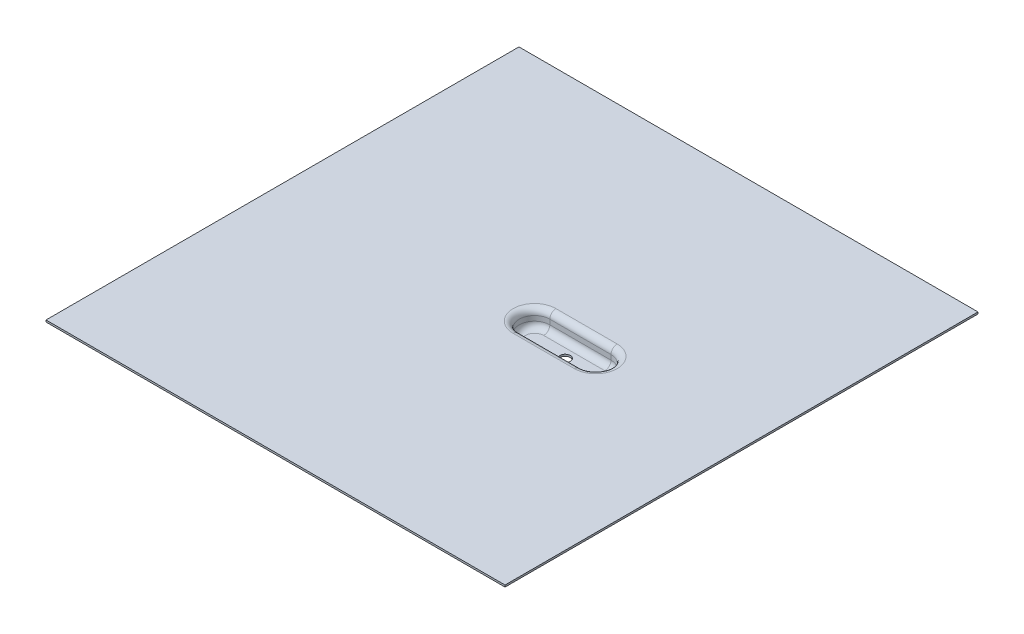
ISO-10303-21;
HEADER;
FILE_DESCRIPTION(('STEP AP214'),'2;1');
FILE_NAME('part.step','',(''),(''),'','','');
FILE_SCHEMA(('AUTOMOTIVE_DESIGN { 1 0 10303 214 1 1 1 1 }'));
ENDSEC;
DATA;
#1=APPLICATION_CONTEXT('core data for automotive mechanical design processes');
#2=APPLICATION_PROTOCOL_DEFINITION('international standard','automotive_design',2000,#1);
#3=PRODUCT_CONTEXT('',#1,'mechanical');
#4=PRODUCT('Part','Part','',(#3));
#5=PRODUCT_RELATED_PRODUCT_CATEGORY('part','',(#4));
#6=PRODUCT_DEFINITION_FORMATION('','',#4);
#7=PRODUCT_DEFINITION_CONTEXT('part definition',#1,'design');
#8=PRODUCT_DEFINITION('design','',#6,#7);
#9=PRODUCT_DEFINITION_SHAPE('','',#8);
#10=(LENGTH_UNIT() NAMED_UNIT(*) SI_UNIT(.MILLI.,.METRE.));
#11=(NAMED_UNIT(*) PLANE_ANGLE_UNIT() SI_UNIT($,.RADIAN.));
#12=(NAMED_UNIT(*) SI_UNIT($,.STERADIAN.) SOLID_ANGLE_UNIT());
#13=UNCERTAINTY_MEASURE_WITH_UNIT(LENGTH_MEASURE(1.E-05),#10,'distance_accuracy_value','');
#14=(GEOMETRIC_REPRESENTATION_CONTEXT(3) GLOBAL_UNCERTAINTY_ASSIGNED_CONTEXT((#13)) GLOBAL_UNIT_ASSIGNED_CONTEXT((#10,
#11,#12)) REPRESENTATION_CONTEXT('',''));
#15=CARTESIAN_POINT('',(0.,0.,0.));
#16=DIRECTION('',(0.,0.,1.));
#17=DIRECTION('',(1.,0.,0.));
#18=AXIS2_PLACEMENT_3D('',#15,#16,#17);
#19=CARTESIAN_POINT('',(0.,-1.524,392.67178905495));
#20=DIRECTION('',(0.,1.,0.));
#21=DIRECTION('',(0.,0.,1.));
#22=AXIS2_PLACEMENT_3D('',#19,#20,#21);
#23=PLANE('',#22);
#24=DIRECTION('',(-1.,0.,0.));
#25=VECTOR('',#24,1.);
#26=CARTESIAN_POINT('',(203.528155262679,-1.52400000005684,172.808276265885));
#27=LINE('',#26,#25);
#28=CARTESIAN_POINT('',(254.328155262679,-1.52400000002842,172.808276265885));
#29=VERTEX_POINT('',#28);
#30=CARTESIAN_POINT('',(203.528155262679,-1.52400000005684,172.808276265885));
#31=VERTEX_POINT('',#30);
#32=EDGE_CURVE('E42',#29,#31,#27,.T.);
#33=ORIENTED_EDGE('',*,*,#32,.T.);
#34=CARTESIAN_POINT('',(203.528155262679,-1.52400000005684,190.588276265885));
#35=DIRECTION('',(0.,1.,0.));
#36=DIRECTION('',(0.,0.,1.));
#37=AXIS2_PLACEMENT_3D('',#34,#35,#36);
#38=CIRCLE('',#37,17.78);
#39=CARTESIAN_POINT('',(203.528155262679,-1.52400000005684,208.368276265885));
#40=VERTEX_POINT('',#39);
#41=EDGE_CURVE('E200',#31,#40,#38,.T.);
#42=ORIENTED_EDGE('',*,*,#41,.T.);
#43=DIRECTION('',(1.,0.,0.));
#44=VECTOR('',#43,1.);
#45=CARTESIAN_POINT('',(203.528155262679,-1.52400000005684,208.368276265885));
#46=LINE('',#45,#44);
#47=CARTESIAN_POINT('',(254.328155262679,-1.52400000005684,208.368276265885));
#48=VERTEX_POINT('',#47);
#49=EDGE_CURVE('E231',#40,#48,#46,.T.);
#50=ORIENTED_EDGE('',*,*,#49,.T.);
#51=CARTESIAN_POINT('',(254.328155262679,-1.52400000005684,190.588276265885));
#52=DIRECTION('',(0.,1.,0.));
#53=DIRECTION('',(0.,0.,1.));
#54=AXIS2_PLACEMENT_3D('',#51,#52,#53);
#55=CIRCLE('',#54,17.78);
#56=EDGE_CURVE('E238',#48,#29,#55,.T.);
#57=ORIENTED_EDGE('',*,*,#56,.T.);
#58=EDGE_LOOP('',(#33,#42,#50,#57));
#59=FACE_BOUND('',#58,.T.);
#60=DIRECTION('',(1.,0.,0.));
#61=VECTOR('',#60,1.);
#62=CARTESIAN_POINT('',(0.,-1.524,0.));
#63=LINE('',#62,#61);
#64=CARTESIAN_POINT('',(0.,-1.524,0.));
#65=VERTEX_POINT('',#64);
#66=CARTESIAN_POINT('',(381.114506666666,-1.524,0.));
#67=VERTEX_POINT('',#66);
#68=EDGE_CURVE('E329',#65,#67,#63,.T.);
#69=ORIENTED_EDGE('',*,*,#68,.T.);
#70=DIRECTION('',(0.,0.,-1.));
#71=VECTOR('',#70,1.);
#72=CARTESIAN_POINT('',(381.114506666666,-1.524,392.67178905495));
#73=LINE('',#72,#71);
#74=CARTESIAN_POINT('',(381.114506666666,-1.524,392.67178905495));
#75=VERTEX_POINT('',#74);
#76=EDGE_CURVE('E11',#75,#67,#73,.T.);
#77=ORIENTED_EDGE('',*,*,#76,.F.);
#78=DIRECTION('',(1.,0.,0.));
#79=VECTOR('',#78,1.);
#80=CARTESIAN_POINT('',(0.,-1.524,392.67178905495));
#81=LINE('',#80,#79);
#82=CARTESIAN_POINT('',(0.,-1.524,392.67178905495));
#83=VERTEX_POINT('',#82);
#84=EDGE_CURVE('E341',#83,#75,#81,.T.);
#85=ORIENTED_EDGE('',*,*,#84,.F.);
#86=DIRECTION('',(0.,0.,-1.));
#87=VECTOR('',#86,1.);
#88=CARTESIAN_POINT('',(0.,-1.524,392.67178905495));
#89=LINE('',#88,#87);
#90=EDGE_CURVE('E352',#83,#65,#89,.T.);
#91=ORIENTED_EDGE('',*,*,#90,.T.);
#92=EDGE_LOOP('',(#69,#77,#85,#91));
#93=FACE_BOUND('',#92,.T.);
#94=ADVANCED_FACE('F28',(#59,#93),#23,.F.);
#95=CARTESIAN_POINT('',(381.114506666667,0.,392.67178905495));
#96=DIRECTION('',(1.,0.,0.));
#97=DIRECTION('',(0.,1.,0.));
#98=AXIS2_PLACEMENT_3D('',#95,#96,#97);
#99=PLANE('',#98);
#100=DIRECTION('',(0.,-1.,0.));
#101=VECTOR('',#100,1.);
#102=CARTESIAN_POINT('',(381.114506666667,0.,0.));
#103=LINE('',#102,#101);
#104=CARTESIAN_POINT('',(381.114506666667,0.,0.));
#105=VERTEX_POINT('',#104);
#106=EDGE_CURVE('E332',#105,#67,#103,.T.);
#107=ORIENTED_EDGE('',*,*,#106,.F.);
#108=DIRECTION('',(0.,0.,-1.));
#109=VECTOR('',#108,1.);
#110=CARTESIAN_POINT('',(381.114506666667,0.,392.67178905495));
#111=LINE('',#110,#109);
#112=CARTESIAN_POINT('',(381.114506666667,0.,392.67178905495));
#113=VERTEX_POINT('',#112);
#114=EDGE_CURVE('E35',#113,#105,#111,.T.);
#115=ORIENTED_EDGE('',*,*,#114,.F.);
#116=DIRECTION('',(0.,-1.,0.));
#117=VECTOR('',#116,1.);
#118=CARTESIAN_POINT('',(381.114506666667,0.,392.67178905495));
#119=LINE('',#118,#117);
#120=EDGE_CURVE('E343',#113,#75,#119,.T.);
#121=ORIENTED_EDGE('',*,*,#120,.T.);
#122=ORIENTED_EDGE('',*,*,#76,.T.);
#123=EDGE_LOOP('',(#107,#115,#121,#122));
#124=FACE_BOUND('',#123,.T.);
#125=ADVANCED_FACE('F362',(#124),#99,.T.);
#126=CARTESIAN_POINT('',(0.,0.,392.67178905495));
#127=DIRECTION('',(0.,1.,0.));
#128=DIRECTION('',(0.,0.,1.));
#129=AXIS2_PLACEMENT_3D('',#126,#127,#128);
#130=PLANE('',#129);
#131=CARTESIAN_POINT('',(254.328155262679,-5.6843418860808E-11,190.588276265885));
#132=DIRECTION('',(0.,1.,0.));
#133=DIRECTION('',(0.,0.,1.));
#134=AXIS2_PLACEMENT_3D('',#131,#132,#133);
#135=CIRCLE('',#134,17.78);
#136=CARTESIAN_POINT('',(254.328155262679,-5.6843418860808E-11,208.368276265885));
#137=VERTEX_POINT('',#136);
#138=CARTESIAN_POINT('',(254.328155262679,-5.6843418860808E-11,172.808276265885));
#139=VERTEX_POINT('',#138);
#140=EDGE_CURVE('E322',#137,#139,#135,.T.);
#141=ORIENTED_EDGE('',*,*,#140,.F.);
#142=DIRECTION('',(-1.,0.,0.));
#143=VECTOR('',#142,1.);
#144=CARTESIAN_POINT('',(254.328155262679,-5.6843418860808E-11,208.368276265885));
#145=LINE('',#144,#143);
#146=CARTESIAN_POINT('',(203.528155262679,-5.6843852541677E-11,208.368276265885));
#147=VERTEX_POINT('',#146);
#148=EDGE_CURVE('E324',#147,#137,#145,.F.);
#149=ORIENTED_EDGE('',*,*,#148,.F.);
#150=CARTESIAN_POINT('',(203.528155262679,-5.6843418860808E-11,190.588276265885));
#151=DIRECTION('',(0.,1.,0.));
#152=DIRECTION('',(0.,0.,1.));
#153=AXIS2_PLACEMENT_3D('',#150,#151,#152);
#154=CIRCLE('',#153,17.78);
#155=CARTESIAN_POINT('',(203.528155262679,0.,172.808276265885));
#156=VERTEX_POINT('',#155);
#157=EDGE_CURVE('E327',#156,#147,#154,.T.);
#158=ORIENTED_EDGE('',*,*,#157,.F.);
#159=DIRECTION('',(1.,0.,0.));
#160=VECTOR('',#159,1.);
#161=CARTESIAN_POINT('',(203.528155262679,-5.6843418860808E-11,172.808276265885));
#162=LINE('',#161,#160);
#163=EDGE_CURVE('E320',#139,#156,#162,.F.);
#164=ORIENTED_EDGE('',*,*,#163,.F.);
#165=EDGE_LOOP('',(#141,#149,#158,#164));
#166=FACE_BOUND('',#165,.T.);
#167=DIRECTION('',(1.,0.,0.));
#168=VECTOR('',#167,1.);
#169=CARTESIAN_POINT('',(0.,0.,0.));
#170=LINE('',#169,#168);
#171=CARTESIAN_POINT('',(0.,0.,0.));
#172=VERTEX_POINT('',#171);
#173=EDGE_CURVE('E335',#172,#105,#170,.T.);
#174=ORIENTED_EDGE('',*,*,#173,.F.);
#175=DIRECTION('',(0.,0.,-1.));
#176=VECTOR('',#175,1.);
#177=CARTESIAN_POINT('',(0.,0.,392.67178905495));
#178=LINE('',#177,#176);
#179=CARTESIAN_POINT('',(0.,0.,392.67178905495));
#180=VERTEX_POINT('',#179);
#181=EDGE_CURVE('E354',#180,#172,#178,.T.);
#182=ORIENTED_EDGE('',*,*,#181,.F.);
#183=DIRECTION('',(1.,0.,0.));
#184=VECTOR('',#183,1.);
#185=CARTESIAN_POINT('',(0.,0.,392.67178905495));
#186=LINE('',#185,#184);
#187=EDGE_CURVE('E346',#180,#113,#186,.T.);
#188=ORIENTED_EDGE('',*,*,#187,.T.);
#189=ORIENTED_EDGE('',*,*,#114,.T.);
#190=EDGE_LOOP('',(#174,#182,#188,#189));
#191=FACE_BOUND('',#190,.T.);
#192=ADVANCED_FACE('F358',(#166,#191),#130,.T.);
#193=CARTESIAN_POINT('',(0.,-1.524,392.67178905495));
#194=DIRECTION('',(-1.,0.,0.));
#195=DIRECTION('',(0.,0.,1.));
#196=AXIS2_PLACEMENT_3D('',#193,#194,#195);
#197=PLANE('',#196);
#198=DIRECTION('',(0.,1.,0.));
#199=VECTOR('',#198,1.);
#200=CARTESIAN_POINT('',(0.,-1.524,0.));
#201=LINE('',#200,#199);
#202=EDGE_CURVE('E338',#65,#172,#201,.T.);
#203=ORIENTED_EDGE('',*,*,#202,.F.);
#204=ORIENTED_EDGE('',*,*,#90,.F.);
#205=DIRECTION('',(0.,1.,0.));
#206=VECTOR('',#205,1.);
#207=CARTESIAN_POINT('',(0.,-1.524,392.67178905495));
#208=LINE('',#207,#206);
#209=EDGE_CURVE('E349',#83,#180,#208,.T.);
#210=ORIENTED_EDGE('',*,*,#209,.T.);
#211=ORIENTED_EDGE('',*,*,#181,.T.);
#212=EDGE_LOOP('',(#203,#204,#210,#211));
#213=FACE_BOUND('',#212,.T.);
#214=ADVANCED_FACE('F369',(#213),#197,.T.);
#215=CARTESIAN_POINT('',(0.,-1.524,392.67178905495));
#216=DIRECTION('',(0.,0.,1.));
#217=DIRECTION('',(1.,0.,0.));
#218=AXIS2_PLACEMENT_3D('',#215,#216,#217);
#219=PLANE('',#218);
#220=ORIENTED_EDGE('',*,*,#84,.T.);
#221=ORIENTED_EDGE('',*,*,#120,.F.);
#222=ORIENTED_EDGE('',*,*,#187,.F.);
#223=ORIENTED_EDGE('',*,*,#209,.F.);
#224=EDGE_LOOP('',(#220,#221,#222,#223));
#225=FACE_BOUND('',#224,.T.);
#226=ADVANCED_FACE('F373',(#225),#219,.T.);
#227=CARTESIAN_POINT('',(0.,-1.524,0.));
#228=DIRECTION('',(0.,0.,1.));
#229=DIRECTION('',(1.,0.,0.));
#230=AXIS2_PLACEMENT_3D('',#227,#228,#229);
#231=PLANE('',#230);
#232=ORIENTED_EDGE('',*,*,#68,.F.);
#233=ORIENTED_EDGE('',*,*,#202,.T.);
#234=ORIENTED_EDGE('',*,*,#173,.T.);
#235=ORIENTED_EDGE('',*,*,#106,.T.);
#236=EDGE_LOOP('',(#232,#233,#234,#235));
#237=FACE_BOUND('',#236,.T.);
#238=ADVANCED_FACE('F366',(#237),#231,.F.);
#239=CARTESIAN_POINT('',(254.328155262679,-5.08000000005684,190.588276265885));
#240=DIRECTION('',(0.,1.,0.));
#241=DIRECTION('',(0.,0.,1.));
#242=AXIS2_PLACEMENT_3D('',#239,#240,#241);
#243=TOROIDAL_SURFACE('',#242,17.78,5.08);
#244=CARTESIAN_POINT('',(254.328155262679,-5.08000000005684,172.808276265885));
#245=DIRECTION('',(1.,0.,0.));
#246=DIRECTION('',(0.,0.,-1.));
#247=AXIS2_PLACEMENT_3D('',#244,#245,#246);
#248=CIRCLE('',#247,5.08);
#249=CARTESIAN_POINT('',(254.328155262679,-5.08000000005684,177.888276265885));
#250=VERTEX_POINT('',#249);
#251=EDGE_CURVE('E316',#139,#250,#248,.T.);
#252=ORIENTED_EDGE('',*,*,#251,.T.);
#253=CARTESIAN_POINT('',(254.328155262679,-5.08000000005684,190.588276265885));
#254=DIRECTION('',(0.,1.,0.));
#255=DIRECTION('',(0.,0.,1.));
#256=AXIS2_PLACEMENT_3D('',#253,#254,#255);
#257=CIRCLE('',#256,12.7);
#258=CARTESIAN_POINT('',(254.328155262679,-5.08000000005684,203.288276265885));
#259=VERTEX_POINT('',#258);
#260=EDGE_CURVE('E286',#250,#259,#257,.F.);
#261=ORIENTED_EDGE('',*,*,#260,.T.);
#262=CARTESIAN_POINT('',(254.328155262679,-5.08000000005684,208.368276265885));
#263=DIRECTION('',(1.,0.,0.));
#264=DIRECTION('',(0.,0.,-1.));
#265=AXIS2_PLACEMENT_3D('',#262,#263,#264);
#266=CIRCLE('',#265,5.08);
#267=EDGE_CURVE('E318',#259,#137,#266,.T.);
#268=ORIENTED_EDGE('',*,*,#267,.T.);
#269=ORIENTED_EDGE('',*,*,#140,.T.);
#270=EDGE_LOOP('',(#252,#261,#268,#269));
#271=FACE_BOUND('',#270,.T.);
#272=ADVANCED_FACE('F491',(#271),#243,.T.);
#273=CARTESIAN_POINT('',(203.528155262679,-5.08000000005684,208.368276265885));
#274=DIRECTION('',(1.,0.,0.));
#275=DIRECTION('',(0.,0.,-1.));
#276=AXIS2_PLACEMENT_3D('',#273,#274,#275);
#277=CYLINDRICAL_SURFACE('',#276,5.08);
#278=ORIENTED_EDGE('',*,*,#267,.F.);
#279=DIRECTION('',(-1.,0.,0.));
#280=VECTOR('',#279,1.);
#281=CARTESIAN_POINT('',(203.528155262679,-5.08000000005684,203.288276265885));
#282=LINE('',#281,#280);
#283=CARTESIAN_POINT('',(203.528155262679,-5.08000000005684,203.288276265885));
#284=VERTEX_POINT('',#283);
#285=EDGE_CURVE('E295',#259,#284,#282,.T.);
#286=ORIENTED_EDGE('',*,*,#285,.T.);
#287=CARTESIAN_POINT('',(203.528155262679,-5.08000000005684,208.368276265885));
#288=DIRECTION('',(1.,0.,0.));
#289=DIRECTION('',(0.,0.,-1.));
#290=AXIS2_PLACEMENT_3D('',#287,#288,#289);
#291=CIRCLE('',#290,5.08);
#292=EDGE_CURVE('E314',#284,#147,#291,.T.);
#293=ORIENTED_EDGE('',*,*,#292,.T.);
#294=ORIENTED_EDGE('',*,*,#148,.T.);
#295=EDGE_LOOP('',(#278,#286,#293,#294));
#296=FACE_BOUND('',#295,.T.);
#297=ADVANCED_FACE('F487',(#296),#277,.T.);
#298=CARTESIAN_POINT('',(203.528155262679,-5.08000000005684,172.808276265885));
#299=DIRECTION('',(-1.,0.,0.));
#300=DIRECTION('',(0.,0.,1.));
#301=AXIS2_PLACEMENT_3D('',#298,#299,#300);
#302=CYLINDRICAL_SURFACE('',#301,5.08);
#303=CARTESIAN_POINT('',(203.528155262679,-5.08000000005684,172.808276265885));
#304=DIRECTION('',(1.,0.,0.));
#305=DIRECTION('',(0.,0.,-1.));
#306=AXIS2_PLACEMENT_3D('',#303,#304,#305);
#307=CIRCLE('',#306,5.08);
#308=CARTESIAN_POINT('',(203.528155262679,-5.08000000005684,177.888276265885));
#309=VERTEX_POINT('',#308);
#310=EDGE_CURVE('E50',#156,#309,#307,.T.);
#311=ORIENTED_EDGE('',*,*,#310,.T.);
#312=DIRECTION('',(1.,0.,0.));
#313=VECTOR('',#312,1.);
#314=CARTESIAN_POINT('',(254.328155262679,-5.08000000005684,177.888276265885));
#315=LINE('',#314,#313);
#316=EDGE_CURVE('E283',#309,#250,#315,.T.);
#317=ORIENTED_EDGE('',*,*,#316,.T.);
#318=ORIENTED_EDGE('',*,*,#251,.F.);
#319=ORIENTED_EDGE('',*,*,#163,.T.);
#320=EDGE_LOOP('',(#311,#317,#318,#319));
#321=FACE_BOUND('',#320,.T.);
#322=ADVANCED_FACE('F484',(#321),#302,.T.);
#323=CARTESIAN_POINT('',(203.528155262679,-5.08000000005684,190.588276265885));
#324=DIRECTION('',(0.,1.,0.));
#325=DIRECTION('',(0.,0.,1.));
#326=AXIS2_PLACEMENT_3D('',#323,#324,#325);
#327=TOROIDAL_SURFACE('',#326,17.78,5.08);
#328=ORIENTED_EDGE('',*,*,#292,.F.);
#329=CARTESIAN_POINT('',(203.528155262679,-5.08000000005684,190.588276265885));
#330=DIRECTION('',(0.,1.,0.));
#331=DIRECTION('',(0.,0.,1.));
#332=AXIS2_PLACEMENT_3D('',#329,#330,#331);
#333=CIRCLE('',#332,12.7);
#334=EDGE_CURVE('E269',#284,#309,#333,.F.);
#335=ORIENTED_EDGE('',*,*,#334,.T.);
#336=ORIENTED_EDGE('',*,*,#310,.F.);
#337=ORIENTED_EDGE('',*,*,#157,.T.);
#338=EDGE_LOOP('',(#328,#335,#336,#337));
#339=FACE_BOUND('',#338,.T.);
#340=ADVANCED_FACE('F480',(#339),#327,.T.);
#341=CARTESIAN_POINT('',(228.928155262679,-14.2240000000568,190.588276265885));
#342=DIRECTION('',(0.,1.,0.));
#343=DIRECTION('',(0.,0.,1.));
#344=AXIS2_PLACEMENT_3D('',#341,#342,#343);
#345=CYLINDRICAL_SURFACE('',#344,4.27717192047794);
#346=CARTESIAN_POINT('',(228.928155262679,-14.2240000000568,190.588276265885));
#347=DIRECTION('',(0.,1.,0.));
#348=DIRECTION('',(0.,0.,1.));
#349=AXIS2_PLACEMENT_3D('',#346,#347,#348);
#350=CIRCLE('',#349,4.27717192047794);
#351=CARTESIAN_POINT('',(228.928155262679,-14.2240000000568,194.865448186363));
#352=VERTEX_POINT('',#351);
#353=EDGE_CURVE('E263',#352,#352,#350,.F.);
#354=ORIENTED_EDGE('',*,*,#353,.F.);
#355=EDGE_LOOP('',(#354));
#356=FACE_BOUND('',#355,.T.);
#357=CARTESIAN_POINT('',(228.928155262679,-15.7480000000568,190.588276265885));
#358=DIRECTION('',(0.,1.,0.));
#359=DIRECTION('',(0.,0.,1.));
#360=AXIS2_PLACEMENT_3D('',#357,#358,#359);
#361=CIRCLE('',#360,4.27717192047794);
#362=CARTESIAN_POINT('',(228.928155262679,-15.7480000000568,194.865448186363));
#363=VERTEX_POINT('',#362);
#364=EDGE_CURVE('E214',#363,#363,#361,.F.);
#365=ORIENTED_EDGE('',*,*,#364,.T.);
#366=EDGE_LOOP('',(#365));
#367=FACE_BOUND('',#366,.T.);
#368=ADVANCED_FACE('F476',(#356,#367),#345,.F.);
#369=CARTESIAN_POINT('',(203.528155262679,-9.14400000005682,198.208276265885));
#370=DIRECTION('',(-1.,0.,0.));
#371=DIRECTION('',(0.,0.,1.));
#372=AXIS2_PLACEMENT_3D('',#369,#370,#371);
#373=CYLINDRICAL_SURFACE('',#372,5.08);
#374=CARTESIAN_POINT('',(254.328155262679,-9.14400000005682,198.208276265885));
#375=DIRECTION('',(-1.,0.,0.));
#376=DIRECTION('',(0.,0.,1.));
#377=AXIS2_PLACEMENT_3D('',#374,#375,#376);
#378=CIRCLE('',#377,5.08);
#379=CARTESIAN_POINT('',(254.328155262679,-14.2240000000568,198.208276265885));
#380=VERTEX_POINT('',#379);
#381=CARTESIAN_POINT('',(254.328155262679,-9.14400000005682,203.288276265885));
#382=VERTEX_POINT('',#381);
#383=EDGE_CURVE('E307',#380,#382,#378,.T.);
#384=ORIENTED_EDGE('',*,*,#383,.F.);
#385=DIRECTION('',(-1.,0.,0.));
#386=VECTOR('',#385,1.);
#387=CARTESIAN_POINT('',(203.528155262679,-14.2240000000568,198.208276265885));
#388=LINE('',#387,#386);
#389=CARTESIAN_POINT('',(203.528155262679,-14.2240000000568,198.208276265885));
#390=VERTEX_POINT('',#389);
#391=EDGE_CURVE('E194',#380,#390,#388,.T.);
#392=ORIENTED_EDGE('',*,*,#391,.T.);
#393=CARTESIAN_POINT('',(203.528155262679,-9.14400000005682,198.208276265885));
#394=DIRECTION('',(1.,0.,0.));
#395=DIRECTION('',(0.,0.,-1.));
#396=AXIS2_PLACEMENT_3D('',#393,#394,#395);
#397=CIRCLE('',#396,5.08);
#398=CARTESIAN_POINT('',(203.528155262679,-9.14400000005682,203.288276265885));
#399=VERTEX_POINT('',#398);
#400=EDGE_CURVE('E310',#399,#390,#397,.T.);
#401=ORIENTED_EDGE('',*,*,#400,.F.);
#402=DIRECTION('',(-1.,0.,0.));
#403=VECTOR('',#402,1.);
#404=CARTESIAN_POINT('',(203.528155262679,-9.14400000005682,203.288276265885));
#405=LINE('',#404,#403);
#406=EDGE_CURVE('E298',#399,#382,#405,.F.);
#407=ORIENTED_EDGE('',*,*,#406,.T.);
#408=EDGE_LOOP('',(#384,#392,#401,#407));
#409=FACE_BOUND('',#408,.T.);
#410=ADVANCED_FACE('F472',(#409),#373,.F.);
#411=CARTESIAN_POINT('',(203.528155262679,-9.14400000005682,190.588276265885));
#412=DIRECTION('',(0.,1.,0.));
#413=DIRECTION('',(0.,0.,1.));
#414=AXIS2_PLACEMENT_3D('',#411,#412,#413);
#415=TOROIDAL_SURFACE('',#414,7.62,5.08);
#416=CARTESIAN_POINT('',(203.528155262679,-9.14400000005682,182.968276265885));
#417=DIRECTION('',(-1.,0.,0.));
#418=DIRECTION('',(0.,0.,1.));
#419=AXIS2_PLACEMENT_3D('',#416,#417,#418);
#420=CIRCLE('',#419,5.08);
#421=CARTESIAN_POINT('',(203.528155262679,-9.14400000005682,177.888276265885));
#422=VERTEX_POINT('',#421);
#423=CARTESIAN_POINT('',(203.528155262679,-14.2240000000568,182.968276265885));
#424=VERTEX_POINT('',#423);
#425=EDGE_CURVE('E301',#422,#424,#420,.T.);
#426=ORIENTED_EDGE('',*,*,#425,.F.);
#427=CARTESIAN_POINT('',(203.528155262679,-9.14400000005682,190.588276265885));
#428=DIRECTION('',(0.,1.,0.));
#429=DIRECTION('',(0.,0.,1.));
#430=AXIS2_PLACEMENT_3D('',#427,#428,#429);
#431=CIRCLE('',#430,12.7);
#432=EDGE_CURVE('E274',#422,#399,#431,.T.);
#433=ORIENTED_EDGE('',*,*,#432,.T.);
#434=ORIENTED_EDGE('',*,*,#400,.T.);
#435=CARTESIAN_POINT('',(203.528155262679,-14.2240000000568,190.588276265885));
#436=DIRECTION('',(0.,1.,0.));
#437=DIRECTION('',(0.,0.,1.));
#438=AXIS2_PLACEMENT_3D('',#435,#436,#437);
#439=CIRCLE('',#438,7.62);
#440=EDGE_CURVE('E258',#390,#424,#439,.F.);
#441=ORIENTED_EDGE('',*,*,#440,.T.);
#442=EDGE_LOOP('',(#426,#433,#434,#441));
#443=FACE_BOUND('',#442,.T.);
#444=ADVANCED_FACE('F468',(#443),#415,.F.);
#445=CARTESIAN_POINT('',(254.328155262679,-9.14400000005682,190.588276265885));
#446=DIRECTION('',(0.,1.,0.));
#447=DIRECTION('',(0.,0.,1.));
#448=AXIS2_PLACEMENT_3D('',#445,#446,#447);
#449=TOROIDAL_SURFACE('',#448,7.62,5.08);
#450=CARTESIAN_POINT('',(254.328155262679,-9.14400000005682,182.968276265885));
#451=DIRECTION('',(1.,0.,0.));
#452=DIRECTION('',(0.,0.,-1.));
#453=AXIS2_PLACEMENT_3D('',#450,#451,#452);
#454=CIRCLE('',#453,5.08);
#455=CARTESIAN_POINT('',(254.328155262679,-14.2240000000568,182.968276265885));
#456=VERTEX_POINT('',#455);
#457=CARTESIAN_POINT('',(254.328155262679,-9.14400000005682,177.888276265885));
#458=VERTEX_POINT('',#457);
#459=EDGE_CURVE('E304',#456,#458,#454,.T.);
#460=ORIENTED_EDGE('',*,*,#459,.F.);
#461=CARTESIAN_POINT('',(254.328155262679,-14.2240000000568,190.588276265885));
#462=DIRECTION('',(0.,1.,0.));
#463=DIRECTION('',(0.,0.,1.));
#464=AXIS2_PLACEMENT_3D('',#461,#462,#463);
#465=CIRCLE('',#464,7.62);
#466=EDGE_CURVE('E191',#456,#380,#465,.F.);
#467=ORIENTED_EDGE('',*,*,#466,.T.);
#468=ORIENTED_EDGE('',*,*,#383,.T.);
#469=CARTESIAN_POINT('',(254.328155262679,-9.14400000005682,190.588276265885));
#470=DIRECTION('',(0.,1.,0.));
#471=DIRECTION('',(0.,0.,1.));
#472=AXIS2_PLACEMENT_3D('',#469,#470,#471);
#473=CIRCLE('',#472,12.7);
#474=EDGE_CURVE('E292',#382,#458,#473,.T.);
#475=ORIENTED_EDGE('',*,*,#474,.T.);
#476=EDGE_LOOP('',(#460,#467,#468,#475));
#477=FACE_BOUND('',#476,.T.);
#478=ADVANCED_FACE('F464',(#477),#449,.F.);
#479=CARTESIAN_POINT('',(203.528155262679,-9.14400000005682,182.968276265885));
#480=DIRECTION('',(1.,0.,0.));
#481=DIRECTION('',(0.,0.,-1.));
#482=AXIS2_PLACEMENT_3D('',#479,#480,#481);
#483=CYLINDRICAL_SURFACE('',#482,5.08);
#484=ORIENTED_EDGE('',*,*,#425,.T.);
#485=DIRECTION('',(1.,0.,0.));
#486=VECTOR('',#485,1.);
#487=CARTESIAN_POINT('',(203.528155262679,-14.2240000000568,182.968276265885));
#488=LINE('',#487,#486);
#489=EDGE_CURVE('E261',#424,#456,#488,.T.);
#490=ORIENTED_EDGE('',*,*,#489,.T.);
#491=ORIENTED_EDGE('',*,*,#459,.T.);
#492=DIRECTION('',(1.,0.,0.));
#493=VECTOR('',#492,1.);
#494=CARTESIAN_POINT('',(203.528155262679,-9.14400000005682,177.888276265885));
#495=LINE('',#494,#493);
#496=EDGE_CURVE('E280',#458,#422,#495,.F.);
#497=ORIENTED_EDGE('',*,*,#496,.T.);
#498=EDGE_LOOP('',(#484,#490,#491,#497));
#499=FACE_BOUND('',#498,.T.);
#500=ADVANCED_FACE('F460',(#499),#483,.F.);
#501=CARTESIAN_POINT('',(203.528155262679,-14.2240000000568,203.288276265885));
#502=DIRECTION('',(0.,0.,-1.));
#503=DIRECTION('',(-1.,0.,0.));
#504=AXIS2_PLACEMENT_3D('',#501,#502,#503);
#505=PLANE('',#504);
#506=DIRECTION('',(0.,1.,0.));
#507=VECTOR('',#506,1.);
#508=CARTESIAN_POINT('',(254.328155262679,-14.2240000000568,203.288276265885));
#509=LINE('',#508,#507);
#510=EDGE_CURVE('E289',#382,#259,#509,.T.);
#511=ORIENTED_EDGE('',*,*,#510,.F.);
#512=ORIENTED_EDGE('',*,*,#406,.F.);
#513=DIRECTION('',(0.,1.,0.));
#514=VECTOR('',#513,1.);
#515=CARTESIAN_POINT('',(203.528155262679,-14.2240000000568,203.288276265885));
#516=LINE('',#515,#514);
#517=EDGE_CURVE('E266',#399,#284,#516,.T.);
#518=ORIENTED_EDGE('',*,*,#517,.T.);
#519=ORIENTED_EDGE('',*,*,#285,.F.);
#520=EDGE_LOOP('',(#511,#512,#518,#519));
#521=FACE_BOUND('',#520,.T.);
#522=ADVANCED_FACE('F456',(#521),#505,.T.);
#523=CARTESIAN_POINT('',(254.328155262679,-14.2240000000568,190.588276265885));
#524=DIRECTION('',(0.,1.,0.));
#525=DIRECTION('',(0.,0.,1.));
#526=AXIS2_PLACEMENT_3D('',#523,#524,#525);
#527=CYLINDRICAL_SURFACE('',#526,12.7);
#528=DIRECTION('',(0.,1.,0.));
#529=VECTOR('',#528,1.);
#530=CARTESIAN_POINT('',(254.328155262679,-14.2240000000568,177.888276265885));
#531=LINE('',#530,#529);
#532=EDGE_CURVE('E277',#458,#250,#531,.T.);
#533=ORIENTED_EDGE('',*,*,#532,.F.);
#534=ORIENTED_EDGE('',*,*,#474,.F.);
#535=ORIENTED_EDGE('',*,*,#510,.T.);
#536=ORIENTED_EDGE('',*,*,#260,.F.);
#537=EDGE_LOOP('',(#533,#534,#535,#536));
#538=FACE_BOUND('',#537,.T.);
#539=ADVANCED_FACE('F452',(#538),#527,.F.);
#540=CARTESIAN_POINT('',(203.528155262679,-14.2240000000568,177.888276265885));
#541=DIRECTION('',(0.,0.,1.));
#542=DIRECTION('',(1.,0.,0.));
#543=AXIS2_PLACEMENT_3D('',#540,#541,#542);
#544=PLANE('',#543);
#545=ORIENTED_EDGE('',*,*,#532,.T.);
#546=ORIENTED_EDGE('',*,*,#316,.F.);
#547=DIRECTION('',(0.,1.,0.));
#548=VECTOR('',#547,1.);
#549=CARTESIAN_POINT('',(203.528155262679,-14.2240000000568,177.888276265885));
#550=LINE('',#549,#548);
#551=EDGE_CURVE('E271',#422,#309,#550,.T.);
#552=ORIENTED_EDGE('',*,*,#551,.F.);
#553=ORIENTED_EDGE('',*,*,#496,.F.);
#554=EDGE_LOOP('',(#545,#546,#552,#553));
#555=FACE_BOUND('',#554,.T.);
#556=ADVANCED_FACE('F448',(#555),#544,.T.);
#557=CARTESIAN_POINT('',(203.528155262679,-14.2240000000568,190.588276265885));
#558=DIRECTION('',(0.,1.,0.));
#559=DIRECTION('',(0.,0.,1.));
#560=AXIS2_PLACEMENT_3D('',#557,#558,#559);
#561=CYLINDRICAL_SURFACE('',#560,12.7);
#562=ORIENTED_EDGE('',*,*,#517,.F.);
#563=ORIENTED_EDGE('',*,*,#432,.F.);
#564=ORIENTED_EDGE('',*,*,#551,.T.);
#565=ORIENTED_EDGE('',*,*,#334,.F.);
#566=EDGE_LOOP('',(#562,#563,#564,#565));
#567=FACE_BOUND('',#566,.T.);
#568=ADVANCED_FACE('F444',(#567),#561,.F.);
#569=CARTESIAN_POINT('',(203.528155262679,-14.2240000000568,190.588276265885));
#570=DIRECTION('',(0.,1.,0.));
#571=DIRECTION('',(0.,0.,1.));
#572=AXIS2_PLACEMENT_3D('',#569,#570,#571);
#573=PLANE('',#572);
#574=ORIENTED_EDGE('',*,*,#466,.F.);
#575=ORIENTED_EDGE('',*,*,#489,.F.);
#576=ORIENTED_EDGE('',*,*,#440,.F.);
#577=ORIENTED_EDGE('',*,*,#391,.F.);
#578=EDGE_LOOP('',(#574,#575,#576,#577));
#579=FACE_BOUND('',#578,.T.);
#580=ORIENTED_EDGE('',*,*,#353,.T.);
#581=EDGE_LOOP('',(#580));
#582=FACE_BOUND('',#581,.T.);
#583=ADVANCED_FACE('F441',(#579,#582),#573,.T.);
#584=CARTESIAN_POINT('',(203.528155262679,-9.14400000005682,198.208276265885));
#585=DIRECTION('',(-1.,0.,0.));
#586=DIRECTION('',(0.,0.,1.));
#587=AXIS2_PLACEMENT_3D('',#584,#585,#586);
#588=CYLINDRICAL_SURFACE('',#587,6.604);
#589=CARTESIAN_POINT('',(254.328155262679,-9.14400000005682,198.208276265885));
#590=DIRECTION('',(-1.,0.,0.));
#591=DIRECTION('',(0.,0.,1.));
#592=AXIS2_PLACEMENT_3D('',#589,#590,#591);
#593=CIRCLE('',#592,6.604);
#594=CARTESIAN_POINT('',(254.328155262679,-15.7480000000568,198.208276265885));
#595=VERTEX_POINT('',#594);
#596=CARTESIAN_POINT('',(254.328155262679,-9.14400000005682,204.812276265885));
#597=VERTEX_POINT('',#596);
#598=EDGE_CURVE('E192',#595,#597,#593,.T.);
#599=ORIENTED_EDGE('',*,*,#598,.T.);
#600=DIRECTION('',(-1.,0.,0.));
#601=VECTOR('',#600,1.);
#602=CARTESIAN_POINT('',(203.528155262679,-9.14400000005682,204.812276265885));
#603=LINE('',#602,#601);
#604=CARTESIAN_POINT('',(203.528155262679,-9.14400000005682,204.812276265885));
#605=VERTEX_POINT('',#604);
#606=EDGE_CURVE('E190',#605,#597,#603,.F.);
#607=ORIENTED_EDGE('',*,*,#606,.F.);
#608=CARTESIAN_POINT('',(203.528155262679,-9.14400000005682,198.208276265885));
#609=DIRECTION('',(-1.,0.,0.));
#610=DIRECTION('',(0.,0.,1.));
#611=AXIS2_PLACEMENT_3D('',#608,#609,#610);
#612=CIRCLE('',#611,6.604);
#613=CARTESIAN_POINT('',(203.528155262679,-15.7480000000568,198.208276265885));
#614=VERTEX_POINT('',#613);
#615=EDGE_CURVE('E171',#605,#614,#612,.F.);
#616=ORIENTED_EDGE('',*,*,#615,.T.);
#617=DIRECTION('',(1.,0.,0.));
#618=VECTOR('',#617,1.);
#619=CARTESIAN_POINT('',(203.528155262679,-15.7480000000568,198.208276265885));
#620=LINE('',#619,#618);
#621=EDGE_CURVE('E177',#595,#614,#620,.F.);
#622=ORIENTED_EDGE('',*,*,#621,.F.);
#623=EDGE_LOOP('',(#599,#607,#616,#622));
#624=FACE_BOUND('',#623,.T.);
#625=ADVANCED_FACE('F188',(#624),#588,.T.);
#626=CARTESIAN_POINT('',(203.528155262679,-9.14400000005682,190.588276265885));
#627=DIRECTION('',(0.,1.,0.));
#628=DIRECTION('',(0.,0.,1.));
#629=AXIS2_PLACEMENT_3D('',#626,#627,#628);
#630=TOROIDAL_SURFACE('',#629,7.62,6.604);
#631=CARTESIAN_POINT('',(203.528155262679,-9.14400000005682,182.968276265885));
#632=DIRECTION('',(1.,0.,0.));
#633=DIRECTION('',(0.,0.,-1.));
#634=AXIS2_PLACEMENT_3D('',#631,#632,#633);
#635=CIRCLE('',#634,6.604);
#636=CARTESIAN_POINT('',(203.528155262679,-9.14400000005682,176.364276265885));
#637=VERTEX_POINT('',#636);
#638=CARTESIAN_POINT('',(203.528155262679,-15.7480000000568,182.968276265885));
#639=VERTEX_POINT('',#638);
#640=EDGE_CURVE('E174',#637,#639,#635,.F.);
#641=ORIENTED_EDGE('',*,*,#640,.T.);
#642=CARTESIAN_POINT('',(203.528155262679,-15.7480000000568,190.588276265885));
#643=DIRECTION('',(0.,1.,0.));
#644=DIRECTION('',(0.,0.,1.));
#645=AXIS2_PLACEMENT_3D('',#642,#643,#644);
#646=CIRCLE('',#645,7.61999999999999);
#647=EDGE_CURVE('E166',#614,#639,#646,.F.);
#648=ORIENTED_EDGE('',*,*,#647,.F.);
#649=ORIENTED_EDGE('',*,*,#615,.F.);
#650=CARTESIAN_POINT('',(203.528155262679,-9.14400000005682,190.588276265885));
#651=DIRECTION('',(0.,1.,0.));
#652=DIRECTION('',(0.,0.,1.));
#653=AXIS2_PLACEMENT_3D('',#650,#651,#652);
#654=CIRCLE('',#653,14.224);
#655=EDGE_CURVE('E202',#637,#605,#654,.T.);
#656=ORIENTED_EDGE('',*,*,#655,.F.);
#657=EDGE_LOOP('',(#641,#648,#649,#656));
#658=FACE_BOUND('',#657,.T.);
#659=ADVANCED_FACE('F168',(#658),#630,.T.);
#660=CARTESIAN_POINT('',(254.328155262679,-9.14400000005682,190.588276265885));
#661=DIRECTION('',(0.,1.,0.));
#662=DIRECTION('',(0.,0.,1.));
#663=AXIS2_PLACEMENT_3D('',#660,#661,#662);
#664=TOROIDAL_SURFACE('',#663,7.62,6.604);
#665=CARTESIAN_POINT('',(254.328155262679,-9.14400000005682,182.968276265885));
#666=DIRECTION('',(1.,0.,0.));
#667=DIRECTION('',(0.,0.,-1.));
#668=AXIS2_PLACEMENT_3D('',#665,#666,#667);
#669=CIRCLE('',#668,6.604);
#670=CARTESIAN_POINT('',(254.328155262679,-15.7480000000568,182.968276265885));
#671=VERTEX_POINT('',#670);
#672=CARTESIAN_POINT('',(254.328155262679,-9.14400000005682,176.364276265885));
#673=VERTEX_POINT('',#672);
#674=EDGE_CURVE('E196',#671,#673,#669,.T.);
#675=ORIENTED_EDGE('',*,*,#674,.T.);
#676=CARTESIAN_POINT('',(254.328155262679,-9.14400000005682,190.588276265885));
#677=DIRECTION('',(0.,1.,0.));
#678=DIRECTION('',(0.,0.,1.));
#679=AXIS2_PLACEMENT_3D('',#676,#677,#678);
#680=CIRCLE('',#679,14.224);
#681=EDGE_CURVE('E215',#597,#673,#680,.T.);
#682=ORIENTED_EDGE('',*,*,#681,.F.);
#683=ORIENTED_EDGE('',*,*,#598,.F.);
#684=CARTESIAN_POINT('',(254.328155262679,-15.7480000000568,190.588276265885));
#685=DIRECTION('',(0.,1.,0.));
#686=DIRECTION('',(0.,0.,1.));
#687=AXIS2_PLACEMENT_3D('',#684,#685,#686);
#688=CIRCLE('',#687,7.61999999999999);
#689=EDGE_CURVE('E183',#671,#595,#688,.F.);
#690=ORIENTED_EDGE('',*,*,#689,.F.);
#691=EDGE_LOOP('',(#675,#682,#683,#690));
#692=FACE_BOUND('',#691,.T.);
#693=ADVANCED_FACE('F412',(#692),#664,.T.);
#694=CARTESIAN_POINT('',(203.528155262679,-9.14400000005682,182.968276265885));
#695=DIRECTION('',(1.,0.,0.));
#696=DIRECTION('',(0.,0.,-1.));
#697=AXIS2_PLACEMENT_3D('',#694,#695,#696);
#698=CYLINDRICAL_SURFACE('',#697,6.604);
#699=ORIENTED_EDGE('',*,*,#640,.F.);
#700=DIRECTION('',(1.,0.,0.));
#701=VECTOR('',#700,1.);
#702=CARTESIAN_POINT('',(203.528155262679,-9.14400000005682,176.364276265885));
#703=LINE('',#702,#701);
#704=EDGE_CURVE('E207',#673,#637,#703,.F.);
#705=ORIENTED_EDGE('',*,*,#704,.F.);
#706=ORIENTED_EDGE('',*,*,#674,.F.);
#707=DIRECTION('',(1.,0.,0.));
#708=VECTOR('',#707,1.);
#709=CARTESIAN_POINT('',(203.528155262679,-15.7480000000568,182.968276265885));
#710=LINE('',#709,#708);
#711=EDGE_CURVE('E176',#639,#671,#710,.T.);
#712=ORIENTED_EDGE('',*,*,#711,.F.);
#713=EDGE_LOOP('',(#699,#705,#706,#712));
#714=FACE_BOUND('',#713,.T.);
#715=ADVANCED_FACE('F410',(#714),#698,.T.);
#716=CARTESIAN_POINT('',(203.528155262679,-5.08000000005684,190.588276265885));
#717=DIRECTION('',(0.,1.,0.));
#718=DIRECTION('',(0.,0.,1.));
#719=AXIS2_PLACEMENT_3D('',#716,#717,#718);
#720=TOROIDAL_SURFACE('',#719,17.78,3.556);
#721=CARTESIAN_POINT('',(203.528155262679,-5.08000000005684,208.368276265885));
#722=DIRECTION('',(-1.,0.,0.));
#723=DIRECTION('',(0.,0.,1.));
#724=AXIS2_PLACEMENT_3D('',#721,#722,#723);
#725=CIRCLE('',#724,3.556);
#726=CARTESIAN_POINT('',(203.528155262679,-5.08000000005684,204.812276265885));
#727=VERTEX_POINT('',#726);
#728=EDGE_CURVE('E228',#727,#40,#725,.F.);
#729=ORIENTED_EDGE('',*,*,#728,.T.);
#730=ORIENTED_EDGE('',*,*,#41,.F.);
#731=CARTESIAN_POINT('',(203.528155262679,-5.08000000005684,172.808276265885));
#732=DIRECTION('',(1.,0.,0.));
#733=DIRECTION('',(0.,0.,-1.));
#734=AXIS2_PLACEMENT_3D('',#731,#732,#733);
#735=CIRCLE('',#734,3.556);
#736=CARTESIAN_POINT('',(203.528155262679,-5.08000000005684,176.364276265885));
#737=VERTEX_POINT('',#736);
#738=EDGE_CURVE('E230',#31,#737,#735,.T.);
#739=ORIENTED_EDGE('',*,*,#738,.T.);
#740=CARTESIAN_POINT('',(203.528155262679,-5.08000000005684,190.588276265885));
#741=DIRECTION('',(0.,1.,0.));
#742=DIRECTION('',(0.,0.,1.));
#743=AXIS2_PLACEMENT_3D('',#740,#741,#742);
#744=CIRCLE('',#743,14.224);
#745=EDGE_CURVE('E227',#727,#737,#744,.F.);
#746=ORIENTED_EDGE('',*,*,#745,.F.);
#747=EDGE_LOOP('',(#729,#730,#739,#746));
#748=FACE_BOUND('',#747,.T.);
#749=ADVANCED_FACE('F397',(#748),#720,.F.);
#750=CARTESIAN_POINT('',(203.528155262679,-5.08000000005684,172.808276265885));
#751=DIRECTION('',(-1.,0.,0.));
#752=DIRECTION('',(0.,0.,1.));
#753=AXIS2_PLACEMENT_3D('',#750,#751,#752);
#754=CYLINDRICAL_SURFACE('',#753,3.556);
#755=CARTESIAN_POINT('',(254.328155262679,-5.08000000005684,172.808276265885));
#756=DIRECTION('',(-1.,0.,0.));
#757=DIRECTION('',(0.,0.,1.));
#758=AXIS2_PLACEMENT_3D('',#755,#756,#757);
#759=CIRCLE('',#758,3.556);
#760=CARTESIAN_POINT('',(254.328155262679,-5.08000000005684,176.364276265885));
#761=VERTEX_POINT('',#760);
#762=EDGE_CURVE('E236',#29,#761,#759,.F.);
#763=ORIENTED_EDGE('',*,*,#762,.T.);
#764=DIRECTION('',(1.,0.,0.));
#765=VECTOR('',#764,1.);
#766=CARTESIAN_POINT('',(203.528155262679,-5.08000000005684,176.364276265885));
#767=LINE('',#766,#765);
#768=EDGE_CURVE('E210',#737,#761,#767,.T.);
#769=ORIENTED_EDGE('',*,*,#768,.F.);
#770=ORIENTED_EDGE('',*,*,#738,.F.);
#771=ORIENTED_EDGE('',*,*,#32,.F.);
#772=EDGE_LOOP('',(#763,#769,#770,#771));
#773=FACE_BOUND('',#772,.T.);
#774=ADVANCED_FACE('F390',(#773),#754,.F.);
#775=CARTESIAN_POINT('',(203.528155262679,-5.08000000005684,208.368276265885));
#776=DIRECTION('',(1.,0.,0.));
#777=DIRECTION('',(0.,0.,-1.));
#778=AXIS2_PLACEMENT_3D('',#775,#776,#777);
#779=CYLINDRICAL_SURFACE('',#778,3.556);
#780=CARTESIAN_POINT('',(254.328155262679,-5.08000000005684,208.368276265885));
#781=DIRECTION('',(1.,0.,0.));
#782=DIRECTION('',(0.,0.,-1.));
#783=AXIS2_PLACEMENT_3D('',#780,#781,#782);
#784=CIRCLE('',#783,3.556);
#785=CARTESIAN_POINT('',(254.328155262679,-5.08000000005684,204.812276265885));
#786=VERTEX_POINT('',#785);
#787=EDGE_CURVE('E241',#786,#48,#784,.T.);
#788=ORIENTED_EDGE('',*,*,#787,.T.);
#789=ORIENTED_EDGE('',*,*,#49,.F.);
#790=ORIENTED_EDGE('',*,*,#728,.F.);
#791=DIRECTION('',(-1.,0.,0.));
#792=VECTOR('',#791,1.);
#793=CARTESIAN_POINT('',(203.528155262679,-5.08000000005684,204.812276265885));
#794=LINE('',#793,#792);
#795=EDGE_CURVE('E218',#786,#727,#794,.T.);
#796=ORIENTED_EDGE('',*,*,#795,.F.);
#797=EDGE_LOOP('',(#788,#789,#790,#796));
#798=FACE_BOUND('',#797,.T.);
#799=ADVANCED_FACE('F400',(#798),#779,.F.);
#800=CARTESIAN_POINT('',(254.328155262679,-5.08000000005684,190.588276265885));
#801=DIRECTION('',(0.,1.,0.));
#802=DIRECTION('',(0.,0.,1.));
#803=AXIS2_PLACEMENT_3D('',#800,#801,#802);
#804=TOROIDAL_SURFACE('',#803,17.78,3.556);
#805=ORIENTED_EDGE('',*,*,#762,.F.);
#806=ORIENTED_EDGE('',*,*,#56,.F.);
#807=ORIENTED_EDGE('',*,*,#787,.F.);
#808=CARTESIAN_POINT('',(254.328155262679,-5.08000000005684,190.588276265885));
#809=DIRECTION('',(0.,1.,0.));
#810=DIRECTION('',(0.,0.,1.));
#811=AXIS2_PLACEMENT_3D('',#808,#809,#810);
#812=CIRCLE('',#811,14.224);
#813=EDGE_CURVE('E222',#761,#786,#812,.F.);
#814=ORIENTED_EDGE('',*,*,#813,.F.);
#815=EDGE_LOOP('',(#805,#806,#807,#814));
#816=FACE_BOUND('',#815,.T.);
#817=ADVANCED_FACE('F387',(#816),#804,.F.);
#818=CARTESIAN_POINT('',(203.528155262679,-14.2240000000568,204.812276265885));
#819=DIRECTION('',(0.,0.,-1.));
#820=DIRECTION('',(-1.,0.,0.));
#821=AXIS2_PLACEMENT_3D('',#818,#819,#820);
#822=PLANE('',#821);
#823=DIRECTION('',(0.,1.,0.));
#824=VECTOR('',#823,1.);
#825=CARTESIAN_POINT('',(254.328155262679,-14.2240000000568,204.812276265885));
#826=LINE('',#825,#824);
#827=EDGE_CURVE('E219',#597,#786,#826,.T.);
#828=ORIENTED_EDGE('',*,*,#827,.T.);
#829=ORIENTED_EDGE('',*,*,#795,.T.);
#830=DIRECTION('',(0.,1.,0.));
#831=VECTOR('',#830,1.);
#832=CARTESIAN_POINT('',(203.528155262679,-14.2240000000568,204.812276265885));
#833=LINE('',#832,#831);
#834=EDGE_CURVE('E225',#605,#727,#833,.T.);
#835=ORIENTED_EDGE('',*,*,#834,.F.);
#836=ORIENTED_EDGE('',*,*,#606,.T.);
#837=EDGE_LOOP('',(#828,#829,#835,#836));
#838=FACE_BOUND('',#837,.T.);
#839=ADVANCED_FACE('F402',(#838),#822,.F.);
#840=CARTESIAN_POINT('',(254.328155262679,-14.2240000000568,190.588276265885));
#841=DIRECTION('',(0.,1.,0.));
#842=DIRECTION('',(0.,0.,1.));
#843=AXIS2_PLACEMENT_3D('',#840,#841,#842);
#844=CYLINDRICAL_SURFACE('',#843,14.224);
#845=DIRECTION('',(0.,1.,0.));
#846=VECTOR('',#845,1.);
#847=CARTESIAN_POINT('',(254.328155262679,-14.2240000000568,176.364276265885));
#848=LINE('',#847,#846);
#849=EDGE_CURVE('E205',#673,#761,#848,.T.);
#850=ORIENTED_EDGE('',*,*,#849,.T.);
#851=ORIENTED_EDGE('',*,*,#813,.T.);
#852=ORIENTED_EDGE('',*,*,#827,.F.);
#853=ORIENTED_EDGE('',*,*,#681,.T.);
#854=EDGE_LOOP('',(#850,#851,#852,#853));
#855=FACE_BOUND('',#854,.T.);
#856=ADVANCED_FACE('F405',(#855),#844,.T.);
#857=CARTESIAN_POINT('',(203.528155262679,-14.2240000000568,176.364276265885));
#858=DIRECTION('',(0.,0.,1.));
#859=DIRECTION('',(1.,0.,0.));
#860=AXIS2_PLACEMENT_3D('',#857,#858,#859);
#861=PLANE('',#860);
#862=ORIENTED_EDGE('',*,*,#849,.F.);
#863=ORIENTED_EDGE('',*,*,#704,.T.);
#864=DIRECTION('',(0.,1.,0.));
#865=VECTOR('',#864,1.);
#866=CARTESIAN_POINT('',(203.528155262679,-14.2240000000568,176.364276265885));
#867=LINE('',#866,#865);
#868=EDGE_CURVE('E206',#637,#737,#867,.T.);
#869=ORIENTED_EDGE('',*,*,#868,.T.);
#870=ORIENTED_EDGE('',*,*,#768,.T.);
#871=EDGE_LOOP('',(#862,#863,#869,#870));
#872=FACE_BOUND('',#871,.T.);
#873=ADVANCED_FACE('F407',(#872),#861,.F.);
#874=CARTESIAN_POINT('',(203.528155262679,-14.2240000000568,190.588276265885));
#875=DIRECTION('',(0.,1.,0.));
#876=DIRECTION('',(0.,0.,1.));
#877=AXIS2_PLACEMENT_3D('',#874,#875,#876);
#878=CYLINDRICAL_SURFACE('',#877,14.224);
#879=ORIENTED_EDGE('',*,*,#834,.T.);
#880=ORIENTED_EDGE('',*,*,#745,.T.);
#881=ORIENTED_EDGE('',*,*,#868,.F.);
#882=ORIENTED_EDGE('',*,*,#655,.T.);
#883=EDGE_LOOP('',(#879,#880,#881,#882));
#884=FACE_BOUND('',#883,.T.);
#885=ADVANCED_FACE('F394',(#884),#878,.T.);
#886=CARTESIAN_POINT('',(203.528155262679,-15.7480000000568,190.588276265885));
#887=DIRECTION('',(0.,1.,0.));
#888=DIRECTION('',(0.,0.,1.));
#889=AXIS2_PLACEMENT_3D('',#886,#887,#888);
#890=PLANE('',#889);
#891=ORIENTED_EDGE('',*,*,#689,.T.);
#892=ORIENTED_EDGE('',*,*,#621,.T.);
#893=ORIENTED_EDGE('',*,*,#647,.T.);
#894=ORIENTED_EDGE('',*,*,#711,.T.);
#895=EDGE_LOOP('',(#891,#892,#893,#894));
#896=FACE_BOUND('',#895,.T.);
#897=ORIENTED_EDGE('',*,*,#364,.F.);
#898=EDGE_LOOP('',(#897));
#899=FACE_BOUND('',#898,.T.);
#900=ADVANCED_FACE('F180',(#896,#899),#890,.F.);
#901=CLOSED_SHELL('',(#94,#125,#192,#214,#226,#238,#272,#297,#322,#340,#368,#410,#444,#478,#500,
#522,#539,#556,#568,#583,#625,#659,#693,#715,#749,#774,#799,#817,#839,#856,#873,#885,#900));
#902=MANIFOLD_SOLID_BREP('B2',#901);
#903=ADVANCED_BREP_SHAPE_REPRESENTATION('',(#18,#902),#14);
#904=SHAPE_DEFINITION_REPRESENTATION(#9,#903);
ENDSEC;
END-ISO-10303-21;
